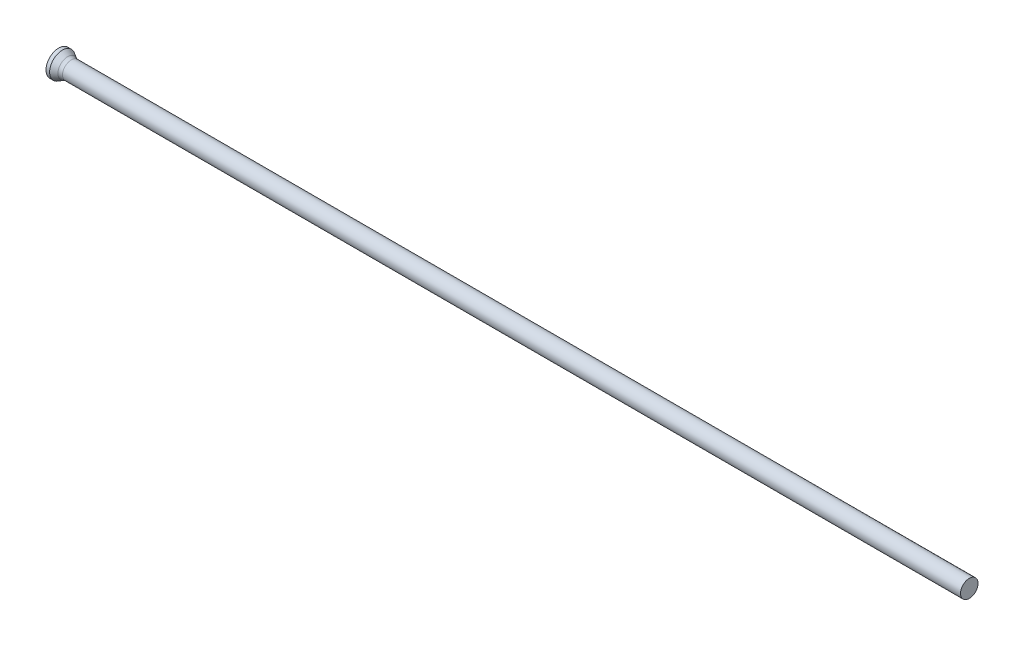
ISO-10303-21;
HEADER;
FILE_DESCRIPTION(('STEP AP214'),'2;1');
FILE_NAME('part.step','',(''),(''),'','','');
FILE_SCHEMA(('AUTOMOTIVE_DESIGN { 1 0 10303 214 1 1 1 1 }'));
ENDSEC;
DATA;
#1=APPLICATION_CONTEXT('core data for automotive mechanical design processes');
#2=APPLICATION_PROTOCOL_DEFINITION('international standard','automotive_design',2000,#1);
#3=PRODUCT_CONTEXT('',#1,'mechanical');
#4=PRODUCT('Part','Part','',(#3));
#5=PRODUCT_RELATED_PRODUCT_CATEGORY('part','',(#4));
#6=PRODUCT_DEFINITION_FORMATION('','',#4);
#7=PRODUCT_DEFINITION_CONTEXT('part definition',#1,'design');
#8=PRODUCT_DEFINITION('design','',#6,#7);
#9=PRODUCT_DEFINITION_SHAPE('','',#8);
#10=(LENGTH_UNIT() NAMED_UNIT(*) SI_UNIT(.MILLI.,.METRE.));
#11=(NAMED_UNIT(*) PLANE_ANGLE_UNIT() SI_UNIT($,.RADIAN.));
#12=(NAMED_UNIT(*) SI_UNIT($,.STERADIAN.) SOLID_ANGLE_UNIT());
#13=UNCERTAINTY_MEASURE_WITH_UNIT(LENGTH_MEASURE(1.E-05),#10,'distance_accuracy_value','');
#14=(GEOMETRIC_REPRESENTATION_CONTEXT(3) GLOBAL_UNCERTAINTY_ASSIGNED_CONTEXT((#13)) GLOBAL_UNIT_ASSIGNED_CONTEXT((#10,
#11,#12)) REPRESENTATION_CONTEXT('',''));
#15=CARTESIAN_POINT('',(0.,0.,0.));
#16=DIRECTION('',(0.,0.,1.));
#17=DIRECTION('',(1.,0.,0.));
#18=AXIS2_PLACEMENT_3D('',#15,#16,#17);
#19=CARTESIAN_POINT('',(0.,0.,0.));
#20=DIRECTION('',(1.,0.,0.));
#21=DIRECTION('',(0.,0.,-1.));
#22=AXIS2_PLACEMENT_3D('',#19,#20,#21);
#23=PLANE('',#22);
#24=CARTESIAN_POINT('',(0.,0.,0.));
#25=DIRECTION('',(-1.,0.,0.));
#26=DIRECTION('',(0.,0.,1.));
#27=AXIS2_PLACEMENT_3D('',#24,#25,#26);
#28=CIRCLE('',#27,1.75);
#29=CARTESIAN_POINT('',(0.,0.,1.75));
#30=VERTEX_POINT('',#29);
#31=EDGE_CURVE('E25',#30,#30,#28,.T.);
#32=ORIENTED_EDGE('',*,*,#31,.T.);
#33=EDGE_LOOP('',(#32));
#34=FACE_BOUND('',#33,.T.);
#35=ADVANCED_FACE('F14',(#34),#23,.F.);
#36=CARTESIAN_POINT('',(0.,0.,0.));
#37=DIRECTION('',(-1.,0.,0.));
#38=DIRECTION('',(0.,0.,1.));
#39=AXIS2_PLACEMENT_3D('',#36,#37,#38);
#40=CYLINDRICAL_SURFACE('',#39,1.75);
#41=ORIENTED_EDGE('',*,*,#31,.F.);
#42=EDGE_LOOP('',(#41));
#43=FACE_BOUND('',#42,.T.);
#44=CARTESIAN_POINT('',(0.497372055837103,0.,0.));
#45=DIRECTION('',(-1.,0.,0.));
#46=DIRECTION('',(0.,0.,1.));
#47=AXIS2_PLACEMENT_3D('',#44,#45,#46);
#48=CIRCLE('',#47,1.75);
#49=CARTESIAN_POINT('',(0.497372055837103,0.,1.75));
#50=VERTEX_POINT('',#49);
#51=EDGE_CURVE('E29',#50,#50,#48,.T.);
#52=ORIENTED_EDGE('',*,*,#51,.T.);
#53=EDGE_LOOP('',(#52));
#54=FACE_BOUND('',#53,.T.);
#55=ADVANCED_FACE('F53',(#43,#54),#40,.T.);
#56=CARTESIAN_POINT('',(1.45,0.,0.));
#57=DIRECTION('',(-1.,0.,0.));
#58=DIRECTION('',(0.,0.,1.));
#59=AXIS2_PLACEMENT_3D('',#56,#57,#58);
#60=CONICAL_SURFACE('',#59,1.2,0.523598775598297);
#61=CARTESIAN_POINT('',(1.21794919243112,0.,0.));
#62=DIRECTION('',(-1.,0.,0.));
#63=DIRECTION('',(0.,0.,1.));
#64=AXIS2_PLACEMENT_3D('',#61,#62,#63);
#65=CIRCLE('',#64,1.33397459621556);
#66=CARTESIAN_POINT('',(1.21794919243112,0.,1.33397459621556));
#67=VERTEX_POINT('',#66);
#68=EDGE_CURVE('E21',#67,#67,#65,.T.);
#69=ORIENTED_EDGE('',*,*,#68,.T.);
#70=EDGE_LOOP('',(#69));
#71=FACE_BOUND('',#70,.T.);
#72=ORIENTED_EDGE('',*,*,#51,.F.);
#73=EDGE_LOOP('',(#72));
#74=FACE_BOUND('',#73,.T.);
#75=ADVANCED_FACE('F50',(#71,#74),#60,.T.);
#76=CARTESIAN_POINT('',(0.,0.,0.));
#77=DIRECTION('',(-1.,0.,0.));
#78=DIRECTION('',(0.,0.,1.));
#79=AXIS2_PLACEMENT_3D('',#76,#77,#78);
#80=CYLINDRICAL_SURFACE('',#79,1.2);
#81=CARTESIAN_POINT('',(1.71794919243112,0.,0.));
#82=DIRECTION('',(-1.,0.,0.));
#83=DIRECTION('',(0.,0.,1.));
#84=AXIS2_PLACEMENT_3D('',#81,#82,#83);
#85=CIRCLE('',#84,1.2);
#86=CARTESIAN_POINT('',(1.71794919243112,0.,1.2));
#87=VERTEX_POINT('',#86);
#88=EDGE_CURVE('E9',#87,#87,#85,.F.);
#89=ORIENTED_EDGE('',*,*,#88,.T.);
#90=EDGE_LOOP('',(#89));
#91=FACE_BOUND('',#90,.T.);
#92=CARTESIAN_POINT('',(125.,0.,0.));
#93=DIRECTION('',(-1.,0.,0.));
#94=DIRECTION('',(0.,0.,1.));
#95=AXIS2_PLACEMENT_3D('',#92,#93,#94);
#96=CIRCLE('',#95,1.2);
#97=CARTESIAN_POINT('',(125.,0.,1.2));
#98=VERTEX_POINT('',#97);
#99=EDGE_CURVE('E34',#98,#98,#96,.T.);
#100=ORIENTED_EDGE('',*,*,#99,.T.);
#101=EDGE_LOOP('',(#100));
#102=FACE_BOUND('',#101,.T.);
#103=ADVANCED_FACE('F38',(#91,#102),#80,.T.);
#104=CARTESIAN_POINT('',(125.,1.2,0.));
#105=DIRECTION('',(-1.,0.,0.));
#106=DIRECTION('',(0.,0.,1.));
#107=AXIS2_PLACEMENT_3D('',#104,#105,#106);
#108=PLANE('',#107);
#109=ORIENTED_EDGE('',*,*,#99,.F.);
#110=EDGE_LOOP('',(#109));
#111=FACE_BOUND('',#110,.T.);
#112=ADVANCED_FACE('F40',(#111),#108,.F.);
#113=CARTESIAN_POINT('',(1.71794919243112,0.,0.));
#114=DIRECTION('',(-1.,0.,0.));
#115=DIRECTION('',(0.,0.,1.));
#116=AXIS2_PLACEMENT_3D('',#113,#114,#115);
#117=TOROIDAL_SURFACE('',#116,2.2,1.);
#118=ORIENTED_EDGE('',*,*,#88,.F.);
#119=EDGE_LOOP('',(#118));
#120=FACE_BOUND('',#119,.T.);
#121=ORIENTED_EDGE('',*,*,#68,.F.);
#122=EDGE_LOOP('',(#121));
#123=FACE_BOUND('',#122,.T.);
#124=ADVANCED_FACE('F16',(#120,#123),#117,.F.);
#125=CLOSED_SHELL('',(#35,#55,#75,#103,#112,#124));
#126=MANIFOLD_SOLID_BREP('B1',#125);
#127=ADVANCED_BREP_SHAPE_REPRESENTATION('',(#18,#126),#14);
#128=SHAPE_DEFINITION_REPRESENTATION(#9,#127);
ENDSEC;
END-ISO-10303-21;
